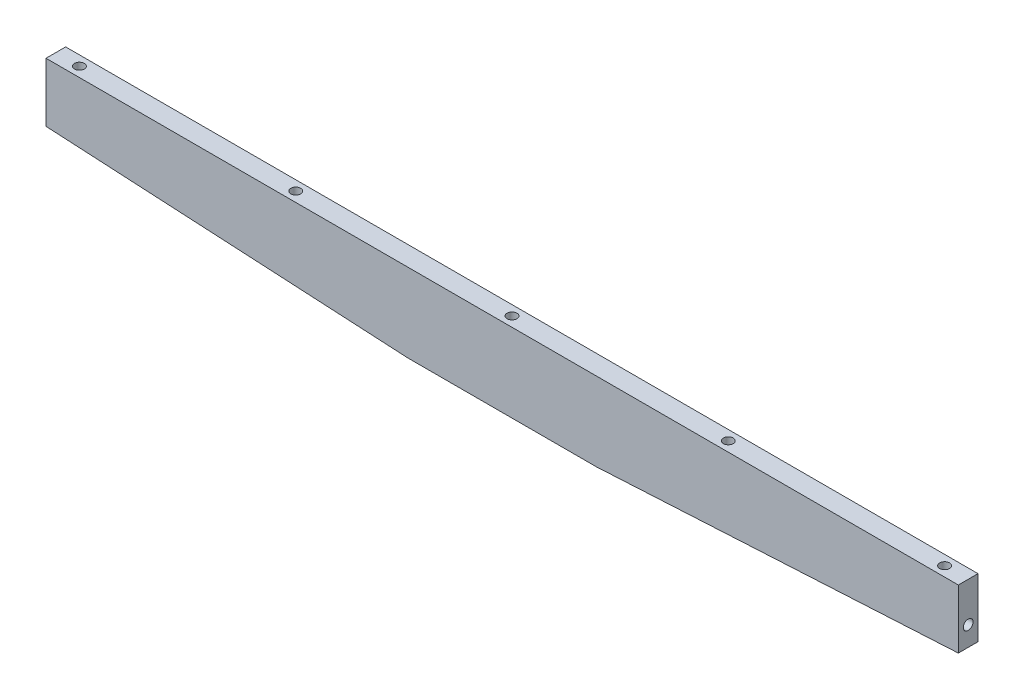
ISO-10303-21;
HEADER;
FILE_DESCRIPTION(('STEP AP214'),'2;1');
FILE_NAME('part.step','',(''),(''),'','','');
FILE_SCHEMA(('AUTOMOTIVE_DESIGN { 1 0 10303 214 1 1 1 1 }'));
ENDSEC;
DATA;
#1=APPLICATION_CONTEXT('core data for automotive mechanical design processes');
#2=APPLICATION_PROTOCOL_DEFINITION('international standard','automotive_design',2000,#1);
#3=PRODUCT_CONTEXT('',#1,'mechanical');
#4=PRODUCT('Part','Part','',(#3));
#5=PRODUCT_RELATED_PRODUCT_CATEGORY('part','',(#4));
#6=PRODUCT_DEFINITION_FORMATION('','',#4);
#7=PRODUCT_DEFINITION_CONTEXT('part definition',#1,'design');
#8=PRODUCT_DEFINITION('design','',#6,#7);
#9=PRODUCT_DEFINITION_SHAPE('','',#8);
#10=(LENGTH_UNIT() NAMED_UNIT(*) SI_UNIT(.MILLI.,.METRE.));
#11=(NAMED_UNIT(*) PLANE_ANGLE_UNIT() SI_UNIT($,.RADIAN.));
#12=(NAMED_UNIT(*) SI_UNIT($,.STERADIAN.) SOLID_ANGLE_UNIT());
#13=UNCERTAINTY_MEASURE_WITH_UNIT(LENGTH_MEASURE(1.E-05),#10,'distance_accuracy_value','');
#14=(GEOMETRIC_REPRESENTATION_CONTEXT(3) GLOBAL_UNCERTAINTY_ASSIGNED_CONTEXT((#13)) GLOBAL_UNIT_ASSIGNED_CONTEXT((#10,
#11,#12)) REPRESENTATION_CONTEXT('',''));
#15=CARTESIAN_POINT('',(0.,0.,0.));
#16=DIRECTION('',(0.,0.,1.));
#17=DIRECTION('',(1.,0.,0.));
#18=AXIS2_PLACEMENT_3D('',#15,#16,#17);
#19=CARTESIAN_POINT('',(-294.64,0.,6.35));
#20=DIRECTION('',(1.,0.,0.));
#21=DIRECTION('',(0.,0.,-1.));
#22=AXIS2_PLACEMENT_3D('',#19,#20,#21);
#23=PLANE('',#22);
#24=CARTESIAN_POINT('',(-294.64,-25.4,0.));
#25=DIRECTION('',(-1.,0.,0.));
#26=DIRECTION('',(0.,0.,1.));
#27=AXIS2_PLACEMENT_3D('',#24,#25,#26);
#28=CIRCLE('',#27,3.175);
#29=CARTESIAN_POINT('',(-294.64,-25.4,3.175));
#30=VERTEX_POINT('',#29);
#31=EDGE_CURVE('E150',#30,#30,#28,.T.);
#32=ORIENTED_EDGE('',*,*,#31,.F.);
#33=EDGE_LOOP('',(#32));
#34=FACE_BOUND('',#33,.T.);
#35=DIRECTION('',(0.,-1.,0.));
#36=VECTOR('',#35,1.);
#37=CARTESIAN_POINT('',(-294.64,0.,-6.35));
#38=LINE('',#37,#36);
#39=CARTESIAN_POINT('',(-294.64,0.,-6.35));
#40=VERTEX_POINT('',#39);
#41=CARTESIAN_POINT('',(-294.64,-38.1,-6.35));
#42=VERTEX_POINT('',#41);
#43=EDGE_CURVE('E132',#40,#42,#38,.T.);
#44=ORIENTED_EDGE('',*,*,#43,.T.);
#45=DIRECTION('',(0.,0.,-1.));
#46=VECTOR('',#45,1.);
#47=CARTESIAN_POINT('',(-294.64,-38.1,6.35));
#48=LINE('',#47,#46);
#49=CARTESIAN_POINT('',(-294.64,-38.1,6.35));
#50=VERTEX_POINT('',#49);
#51=EDGE_CURVE('E13',#50,#42,#48,.T.);
#52=ORIENTED_EDGE('',*,*,#51,.F.);
#53=DIRECTION('',(0.,-1.,0.));
#54=VECTOR('',#53,1.);
#55=CARTESIAN_POINT('',(-294.64,0.,6.35));
#56=LINE('',#55,#54);
#57=CARTESIAN_POINT('',(-294.64,0.,6.35));
#58=VERTEX_POINT('',#57);
#59=EDGE_CURVE('E143',#58,#50,#56,.T.);
#60=ORIENTED_EDGE('',*,*,#59,.F.);
#61=DIRECTION('',(0.,0.,-1.));
#62=VECTOR('',#61,1.);
#63=CARTESIAN_POINT('',(-294.64,0.,6.35));
#64=LINE('',#63,#62);
#65=EDGE_CURVE('E128',#58,#40,#64,.T.);
#66=ORIENTED_EDGE('',*,*,#65,.T.);
#67=EDGE_LOOP('',(#44,#52,#60,#66));
#68=FACE_BOUND('',#67,.T.);
#69=ADVANCED_FACE('F46',(#34,#68),#23,.F.);
#70=CARTESIAN_POINT('',(-294.64,-38.1,6.35));
#71=DIRECTION('',(0.0542677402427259,0.998526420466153,0.));
#72=DIRECTION('',(-0.998526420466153,0.0542677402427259,0.));
#73=AXIS2_PLACEMENT_3D('',#70,#71,#72);
#74=PLANE('',#73);
#75=CARTESIAN_POINT('',(-250.19,-40.5157608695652,0.));
#76=DIRECTION('',(0.0542677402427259,0.998526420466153,0.));
#77=DIRECTION('',(0.998526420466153,-0.0542677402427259,0.));
#78=AXIS2_PLACEMENT_3D('',#75,#76,#77);
#79=ELLIPSE('',#78,3.17968551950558,3.17499999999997);
#80=CARTESIAN_POINT('',(-247.015,-40.6883152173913,0.));
#81=VERTEX_POINT('',#80);
#82=EDGE_CURVE('E49',#81,#81,#79,.T.);
#83=ORIENTED_EDGE('',*,*,#82,.T.);
#84=EDGE_LOOP('',(#83));
#85=FACE_BOUND('',#84,.T.);
#86=DIRECTION('',(0.998526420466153,-0.0542677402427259,0.));
#87=VECTOR('',#86,1.);
#88=CARTESIAN_POINT('',(-294.64,-38.1,-6.35));
#89=LINE('',#88,#87);
#90=CARTESIAN_POINT('',(-60.96,-50.8,-6.35));
#91=VERTEX_POINT('',#90);
#92=EDGE_CURVE('E135',#42,#91,#89,.T.);
#93=ORIENTED_EDGE('',*,*,#92,.T.);
#94=DIRECTION('',(0.,0.,-1.));
#95=VECTOR('',#94,1.);
#96=CARTESIAN_POINT('',(-60.96,-50.8,6.35));
#97=LINE('',#96,#95);
#98=CARTESIAN_POINT('',(-60.96,-50.8,6.35));
#99=VERTEX_POINT('',#98);
#100=EDGE_CURVE('E55',#99,#91,#97,.T.);
#101=ORIENTED_EDGE('',*,*,#100,.F.);
#102=DIRECTION('',(0.998526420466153,-0.0542677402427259,0.));
#103=VECTOR('',#102,1.);
#104=CARTESIAN_POINT('',(-294.64,-38.1,6.35));
#105=LINE('',#104,#103);
#106=EDGE_CURVE('E101',#50,#99,#105,.T.);
#107=ORIENTED_EDGE('',*,*,#106,.F.);
#108=ORIENTED_EDGE('',*,*,#51,.T.);
#109=EDGE_LOOP('',(#93,#101,#107,#108));
#110=FACE_BOUND('',#109,.T.);
#111=ADVANCED_FACE('F201',(#85,#110),#74,.F.);
#112=CARTESIAN_POINT('',(-60.96,-50.8,6.35));
#113=DIRECTION('',(0.,1.,0.));
#114=DIRECTION('',(0.,0.,1.));
#115=AXIS2_PLACEMENT_3D('',#112,#113,#114);
#116=PLANE('',#115);
#117=DIRECTION('',(1.,0.,0.));
#118=VECTOR('',#117,1.);
#119=CARTESIAN_POINT('',(-60.96,-50.8,-6.35));
#120=LINE('',#119,#118);
#121=CARTESIAN_POINT('',(60.96,-50.8,-6.35));
#122=VERTEX_POINT('',#121);
#123=EDGE_CURVE('E138',#91,#122,#120,.T.);
#124=ORIENTED_EDGE('',*,*,#123,.T.);
#125=DIRECTION('',(0.,0.,-1.));
#126=VECTOR('',#125,1.);
#127=CARTESIAN_POINT('',(60.96,-50.8,6.35));
#128=LINE('',#127,#126);
#129=CARTESIAN_POINT('',(60.96,-50.8,6.35));
#130=VERTEX_POINT('',#129);
#131=EDGE_CURVE('E123',#130,#122,#128,.T.);
#132=ORIENTED_EDGE('',*,*,#131,.F.);
#133=DIRECTION('',(1.,0.,0.));
#134=VECTOR('',#133,1.);
#135=CARTESIAN_POINT('',(-60.96,-50.8,6.35));
#136=LINE('',#135,#134);
#137=EDGE_CURVE('E114',#99,#130,#136,.T.);
#138=ORIENTED_EDGE('',*,*,#137,.F.);
#139=ORIENTED_EDGE('',*,*,#100,.T.);
#140=EDGE_LOOP('',(#124,#132,#138,#139));
#141=FACE_BOUND('',#140,.T.);
#142=ADVANCED_FACE('F204',(#141),#116,.F.);
#143=CARTESIAN_POINT('',(294.64,-38.1,6.35));
#144=DIRECTION('',(-0.0542677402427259,0.998526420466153,0.));
#145=DIRECTION('',(-0.998526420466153,-0.0542677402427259,0.));
#146=AXIS2_PLACEMENT_3D('',#143,#144,#145);
#147=PLANE('',#146);
#148=CARTESIAN_POINT('',(250.19,-40.5157608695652,0.));
#149=DIRECTION('',(-0.0542677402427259,0.998526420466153,0.));
#150=DIRECTION('',(-0.998526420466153,-0.0542677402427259,0.));
#151=AXIS2_PLACEMENT_3D('',#148,#149,#150);
#152=ELLIPSE('',#151,3.17968551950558,3.17499999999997);
#153=CARTESIAN_POINT('',(247.015,-40.6883152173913,0.));
#154=VERTEX_POINT('',#153);
#155=EDGE_CURVE('E148',#154,#154,#152,.F.);
#156=ORIENTED_EDGE('',*,*,#155,.F.);
#157=EDGE_LOOP('',(#156));
#158=FACE_BOUND('',#157,.T.);
#159=DIRECTION('',(0.998526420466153,0.0542677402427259,0.));
#160=VECTOR('',#159,1.);
#161=CARTESIAN_POINT('',(294.64,-38.1,-6.35));
#162=LINE('',#161,#160);
#163=CARTESIAN_POINT('',(294.64,-38.1,-6.35));
#164=VERTEX_POINT('',#163);
#165=EDGE_CURVE('E122',#122,#164,#162,.T.);
#166=ORIENTED_EDGE('',*,*,#165,.T.);
#167=DIRECTION('',(0.,0.,-1.));
#168=VECTOR('',#167,1.);
#169=CARTESIAN_POINT('',(294.64,-38.1,6.35));
#170=LINE('',#169,#168);
#171=CARTESIAN_POINT('',(294.64,-38.1,6.35));
#172=VERTEX_POINT('',#171);
#173=EDGE_CURVE('E119',#172,#164,#170,.T.);
#174=ORIENTED_EDGE('',*,*,#173,.F.);
#175=DIRECTION('',(0.998526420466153,0.0542677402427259,0.));
#176=VECTOR('',#175,1.);
#177=CARTESIAN_POINT('',(294.64,-38.1,6.35));
#178=LINE('',#177,#176);
#179=EDGE_CURVE('E108',#130,#172,#178,.T.);
#180=ORIENTED_EDGE('',*,*,#179,.F.);
#181=ORIENTED_EDGE('',*,*,#131,.T.);
#182=EDGE_LOOP('',(#166,#174,#180,#181));
#183=FACE_BOUND('',#182,.T.);
#184=ADVANCED_FACE('F120',(#158,#183),#147,.F.);
#185=CARTESIAN_POINT('',(294.64,0.,6.35));
#186=DIRECTION('',(-1.,0.,0.));
#187=DIRECTION('',(0.,0.,1.));
#188=AXIS2_PLACEMENT_3D('',#185,#186,#187);
#189=PLANE('',#188);
#190=CARTESIAN_POINT('',(294.64,-25.4,0.));
#191=DIRECTION('',(-1.,0.,0.));
#192=DIRECTION('',(0.,0.,1.));
#193=AXIS2_PLACEMENT_3D('',#190,#191,#192);
#194=CIRCLE('',#193,3.175);
#195=CARTESIAN_POINT('',(294.64,-25.4,-3.175));
#196=VERTEX_POINT('',#195);
#197=EDGE_CURVE('E163',#196,#196,#194,.T.);
#198=ORIENTED_EDGE('',*,*,#197,.T.);
#199=EDGE_LOOP('',(#198));
#200=FACE_BOUND('',#199,.T.);
#201=DIRECTION('',(0.,1.,0.));
#202=VECTOR('',#201,1.);
#203=CARTESIAN_POINT('',(294.64,0.,-6.35));
#204=LINE('',#203,#202);
#205=CARTESIAN_POINT('',(294.64,0.,-6.35));
#206=VERTEX_POINT('',#205);
#207=EDGE_CURVE('E87',#164,#206,#204,.T.);
#208=ORIENTED_EDGE('',*,*,#207,.T.);
#209=DIRECTION('',(0.,0.,-1.));
#210=VECTOR('',#209,1.);
#211=CARTESIAN_POINT('',(294.64,0.,6.35));
#212=LINE('',#211,#210);
#213=CARTESIAN_POINT('',(294.64,0.,6.35));
#214=VERTEX_POINT('',#213);
#215=EDGE_CURVE('E124',#214,#206,#212,.T.);
#216=ORIENTED_EDGE('',*,*,#215,.F.);
#217=DIRECTION('',(0.,1.,0.));
#218=VECTOR('',#217,1.);
#219=CARTESIAN_POINT('',(294.64,0.,6.35));
#220=LINE('',#219,#218);
#221=EDGE_CURVE('E112',#172,#214,#220,.T.);
#222=ORIENTED_EDGE('',*,*,#221,.F.);
#223=ORIENTED_EDGE('',*,*,#173,.T.);
#224=EDGE_LOOP('',(#208,#216,#222,#223));
#225=FACE_BOUND('',#224,.T.);
#226=ADVANCED_FACE('F126',(#200,#225),#189,.F.);
#227=CARTESIAN_POINT('',(294.64,0.,6.35));
#228=DIRECTION('',(0.,-1.,0.));
#229=DIRECTION('',(0.,0.,-1.));
#230=AXIS2_PLACEMENT_3D('',#227,#228,#229);
#231=PLANE('',#230);
#232=CARTESIAN_POINT('',(-139.7,0.,0.));
#233=DIRECTION('',(0.,1.,0.));
#234=DIRECTION('',(0.,0.,1.));
#235=AXIS2_PLACEMENT_3D('',#232,#233,#234);
#236=CIRCLE('',#235,3.17499999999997);
#237=CARTESIAN_POINT('',(-139.7,0.,3.17499999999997));
#238=VERTEX_POINT('',#237);
#239=EDGE_CURVE('E174',#238,#238,#236,.T.);
#240=ORIENTED_EDGE('',*,*,#239,.F.);
#241=EDGE_LOOP('',(#240));
#242=FACE_BOUND('',#241,.T.);
#243=CARTESIAN_POINT('',(0.,0.,0.));
#244=DIRECTION('',(0.,1.,0.));
#245=DIRECTION('',(0.,0.,1.));
#246=AXIS2_PLACEMENT_3D('',#243,#244,#245);
#247=CIRCLE('',#246,3.17499999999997);
#248=CARTESIAN_POINT('',(0.,0.,3.17499999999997));
#249=VERTEX_POINT('',#248);
#250=EDGE_CURVE('E180',#249,#249,#247,.T.);
#251=ORIENTED_EDGE('',*,*,#250,.F.);
#252=EDGE_LOOP('',(#251));
#253=FACE_BOUND('',#252,.T.);
#254=CARTESIAN_POINT('',(139.7,0.,0.));
#255=DIRECTION('',(0.,1.,0.));
#256=DIRECTION('',(0.,0.,1.));
#257=AXIS2_PLACEMENT_3D('',#254,#255,#256);
#258=CIRCLE('',#257,3.17499999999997);
#259=CARTESIAN_POINT('',(139.7,0.,3.17499999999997));
#260=VERTEX_POINT('',#259);
#261=EDGE_CURVE('E186',#260,#260,#258,.T.);
#262=ORIENTED_EDGE('',*,*,#261,.F.);
#263=EDGE_LOOP('',(#262));
#264=FACE_BOUND('',#263,.T.);
#265=CARTESIAN_POINT('',(279.4,0.,0.));
#266=DIRECTION('',(0.,1.,0.));
#267=DIRECTION('',(0.,0.,1.));
#268=AXIS2_PLACEMENT_3D('',#265,#266,#267);
#269=CIRCLE('',#268,3.17499999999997);
#270=CARTESIAN_POINT('',(279.4,0.,3.17499999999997));
#271=VERTEX_POINT('',#270);
#272=EDGE_CURVE('E168',#271,#271,#269,.T.);
#273=ORIENTED_EDGE('',*,*,#272,.F.);
#274=EDGE_LOOP('',(#273));
#275=FACE_BOUND('',#274,.T.);
#276=CARTESIAN_POINT('',(-279.4,0.,0.));
#277=DIRECTION('',(0.,1.,0.));
#278=DIRECTION('',(0.,0.,1.));
#279=AXIS2_PLACEMENT_3D('',#276,#277,#278);
#280=CIRCLE('',#279,3.17499999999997);
#281=CARTESIAN_POINT('',(-279.4,0.,3.17499999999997));
#282=VERTEX_POINT('',#281);
#283=EDGE_CURVE('E173',#282,#282,#280,.T.);
#284=ORIENTED_EDGE('',*,*,#283,.F.);
#285=EDGE_LOOP('',(#284));
#286=FACE_BOUND('',#285,.T.);
#287=DIRECTION('',(-1.,0.,0.));
#288=VECTOR('',#287,1.);
#289=CARTESIAN_POINT('',(294.64,0.,-6.35));
#290=LINE('',#289,#288);
#291=EDGE_CURVE('E93',#206,#40,#290,.T.);
#292=ORIENTED_EDGE('',*,*,#291,.T.);
#293=ORIENTED_EDGE('',*,*,#65,.F.);
#294=DIRECTION('',(-1.,0.,0.));
#295=VECTOR('',#294,1.);
#296=CARTESIAN_POINT('',(294.64,0.,6.35));
#297=LINE('',#296,#295);
#298=EDGE_CURVE('E64',#214,#58,#297,.T.);
#299=ORIENTED_EDGE('',*,*,#298,.F.);
#300=ORIENTED_EDGE('',*,*,#215,.T.);
#301=EDGE_LOOP('',(#292,#293,#299,#300));
#302=FACE_BOUND('',#301,.T.);
#303=ADVANCED_FACE('F209',(#242,#253,#264,#275,#286,#302),#231,.F.);
#304=CARTESIAN_POINT('',(0.,0.,6.35));
#305=DIRECTION('',(0.,0.,1.));
#306=DIRECTION('',(1.,0.,0.));
#307=AXIS2_PLACEMENT_3D('',#304,#305,#306);
#308=PLANE('',#307);
#309=ORIENTED_EDGE('',*,*,#59,.T.);
#310=ORIENTED_EDGE('',*,*,#106,.T.);
#311=ORIENTED_EDGE('',*,*,#137,.T.);
#312=ORIENTED_EDGE('',*,*,#179,.T.);
#313=ORIENTED_EDGE('',*,*,#221,.T.);
#314=ORIENTED_EDGE('',*,*,#298,.T.);
#315=EDGE_LOOP('',(#309,#310,#311,#312,#313,#314));
#316=FACE_BOUND('',#315,.T.);
#317=ADVANCED_FACE('F110',(#316),#308,.T.);
#318=CARTESIAN_POINT('',(0.,0.,-6.35));
#319=DIRECTION('',(0.,0.,1.));
#320=DIRECTION('',(1.,0.,0.));
#321=AXIS2_PLACEMENT_3D('',#318,#319,#320);
#322=PLANE('',#321);
#323=ORIENTED_EDGE('',*,*,#43,.F.);
#324=ORIENTED_EDGE('',*,*,#291,.F.);
#325=ORIENTED_EDGE('',*,*,#207,.F.);
#326=ORIENTED_EDGE('',*,*,#165,.F.);
#327=ORIENTED_EDGE('',*,*,#123,.F.);
#328=ORIENTED_EDGE('',*,*,#92,.F.);
#329=EDGE_LOOP('',(#323,#324,#325,#326,#327,#328));
#330=FACE_BOUND('',#329,.T.);
#331=ADVANCED_FACE('F207',(#330),#322,.F.);
#332=CARTESIAN_POINT('',(-279.4,-19.05,0.));
#333=DIRECTION('',(0.,1.,0.));
#334=DIRECTION('',(0.,0.,1.));
#335=AXIS2_PLACEMENT_3D('',#332,#333,#334);
#336=CYLINDRICAL_SURFACE('',#335,3.17499999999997);
#337=CARTESIAN_POINT('',(-279.4,-19.05,0.));
#338=DIRECTION('',(0.,1.,0.));
#339=DIRECTION('',(0.,0.,1.));
#340=AXIS2_PLACEMENT_3D('',#337,#338,#339);
#341=CIRCLE('',#340,3.17499999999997);
#342=CARTESIAN_POINT('',(-279.4,-19.05,3.17499999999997));
#343=VERTEX_POINT('',#342);
#344=EDGE_CURVE('E136',#343,#343,#341,.T.);
#345=CARTESIAN_POINT('',(-279.4,-19.05,3.17499999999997));
#346=CARTESIAN_POINT('',(-279.4,-18.8515625,3.17499999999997));
#347=CARTESIAN_POINT('',(-279.4,-18.653125,3.17499999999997));
#348=CARTESIAN_POINT('',(-279.4,-18.25625,3.17499999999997));
#349=CARTESIAN_POINT('',(-279.4,-18.0578125,3.17499999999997));
#350=CARTESIAN_POINT('',(-279.4,-17.6609375,3.17499999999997));
#351=CARTESIAN_POINT('',(-279.4,-17.4625,3.17499999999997));
#352=CARTESIAN_POINT('',(-279.4,-17.065625,3.17499999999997));
#353=CARTESIAN_POINT('',(-279.4,-16.8671875,3.17499999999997));
#354=CARTESIAN_POINT('',(-279.4,-16.4703125,3.17499999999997));
#355=CARTESIAN_POINT('',(-279.4,-16.271875,3.17499999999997));
#356=CARTESIAN_POINT('',(-279.4,-15.875,3.17499999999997));
#357=CARTESIAN_POINT('',(-279.4,-15.6765625,3.17499999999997));
#358=CARTESIAN_POINT('',(-279.4,-15.2796875,3.17499999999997));
#359=CARTESIAN_POINT('',(-279.4,-15.08125,3.17499999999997));
#360=CARTESIAN_POINT('',(-279.4,-14.684375,3.17499999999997));
#361=CARTESIAN_POINT('',(-279.4,-14.4859375,3.17499999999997));
#362=CARTESIAN_POINT('',(-279.4,-14.0890625,3.17499999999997));
#363=CARTESIAN_POINT('',(-279.4,-13.890625,3.17499999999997));
#364=CARTESIAN_POINT('',(-279.4,-13.49375,3.17499999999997));
#365=CARTESIAN_POINT('',(-279.4,-13.2953125,3.17499999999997));
#366=CARTESIAN_POINT('',(-279.4,-12.8984375,3.17499999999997));
#367=CARTESIAN_POINT('',(-279.4,-12.7,3.17499999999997));
#368=CARTESIAN_POINT('',(-279.4,-12.303125,3.17499999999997));
#369=CARTESIAN_POINT('',(-279.4,-12.1046875,3.17499999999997));
#370=CARTESIAN_POINT('',(-279.4,-11.7078125,3.17499999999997));
#371=CARTESIAN_POINT('',(-279.4,-11.509375,3.17499999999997));
#372=CARTESIAN_POINT('',(-279.4,-11.1125,3.17499999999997));
#373=CARTESIAN_POINT('',(-279.4,-10.9140625,3.17499999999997));
#374=CARTESIAN_POINT('',(-279.4,-10.5171875,3.17499999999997));
#375=CARTESIAN_POINT('',(-279.4,-10.31875,3.17499999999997));
#376=CARTESIAN_POINT('',(-279.4,-9.921875,3.17499999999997));
#377=CARTESIAN_POINT('',(-279.4,-9.7234375,3.17499999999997));
#378=CARTESIAN_POINT('',(-279.4,-9.3265625,3.17499999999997));
#379=CARTESIAN_POINT('',(-279.4,-9.128125,3.17499999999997));
#380=CARTESIAN_POINT('',(-279.4,-8.73125,3.17499999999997));
#381=CARTESIAN_POINT('',(-279.4,-8.5328125,3.17499999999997));
#382=CARTESIAN_POINT('',(-279.4,-8.1359375,3.17499999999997));
#383=CARTESIAN_POINT('',(-279.4,-7.9375,3.17499999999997));
#384=CARTESIAN_POINT('',(-279.4,-7.540625,3.17499999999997));
#385=CARTESIAN_POINT('',(-279.4,-7.3421875,3.17499999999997));
#386=CARTESIAN_POINT('',(-279.4,-6.9453125,3.17499999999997));
#387=CARTESIAN_POINT('',(-279.4,-6.746875,3.17499999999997));
#388=CARTESIAN_POINT('',(-279.4,-6.35,3.17499999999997));
#389=CARTESIAN_POINT('',(-279.4,-6.1515625,3.17499999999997));
#390=CARTESIAN_POINT('',(-279.4,-5.7546875,3.17499999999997));
#391=CARTESIAN_POINT('',(-279.4,-5.55625,3.17499999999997));
#392=CARTESIAN_POINT('',(-279.4,-5.159375,3.17499999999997));
#393=CARTESIAN_POINT('',(-279.4,-4.9609375,3.17499999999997));
#394=CARTESIAN_POINT('',(-279.4,-4.5640625,3.17499999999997));
#395=CARTESIAN_POINT('',(-279.4,-4.365625,3.17499999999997));
#396=CARTESIAN_POINT('',(-279.4,-3.96875,3.17499999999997));
#397=CARTESIAN_POINT('',(-279.4,-3.7703125,3.17499999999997));
#398=CARTESIAN_POINT('',(-279.4,-3.3734375,3.17499999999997));
#399=CARTESIAN_POINT('',(-279.4,-3.175,3.17499999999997));
#400=CARTESIAN_POINT('',(-279.4,-2.778125,3.17499999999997));
#401=CARTESIAN_POINT('',(-279.4,-2.5796875,3.17499999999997));
#402=CARTESIAN_POINT('',(-279.4,-2.1828125,3.17499999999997));
#403=CARTESIAN_POINT('',(-279.4,-1.984375,3.17499999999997));
#404=CARTESIAN_POINT('',(-279.4,-1.5875,3.17499999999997));
#405=CARTESIAN_POINT('',(-279.4,-1.3890625,3.17499999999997));
#406=CARTESIAN_POINT('',(-279.4,-0.992187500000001,3.17499999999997));
#407=CARTESIAN_POINT('',(-279.4,-0.793750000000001,3.17499999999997));
#408=CARTESIAN_POINT('',(-279.4,-0.396875,3.17499999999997));
#409=CARTESIAN_POINT('',(-279.4,-0.1984375,3.17499999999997));
#410=CARTESIAN_POINT('',(-279.4,0.,3.17499999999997));
#411=B_SPLINE_CURVE_WITH_KNOTS('',3,(#345,#346,#347,#348,#349,#350,#351,#352,#353,#354,#355,
#356,#357,#358,#359,#360,#361,#362,#363,#364,#365,#366,#367,#368,#369,#370,#371,#372,#373,#374,
#375,#376,#377,#378,#379,#380,#381,#382,#383,#384,#385,#386,#387,#388,#389,#390,#391,#392,#393,
#394,#395,#396,#397,#398,#399,#400,#401,#402,#403,#404,#405,#406,#407,#408,#409,#410),
.UNSPECIFIED.,.F.,.F.,(4,2,2,2,2,2,2,2,2,2,2,2,2,2,2,2,2,2,2,2,2,2,2,2,2,2,2,2,2,2,2,2,4),(0.,
0.5953125,1.190625,1.7859375,2.38125,2.9765625,3.571875,4.1671875,4.7625,5.3578125,5.953125,
6.5484375,7.14375,7.7390625,8.334375,8.9296875,9.525,10.1203125,10.715625,11.3109375,11.90625,
12.5015625,13.096875,13.6921875,14.2875,14.8828125,15.478125,16.0734375,16.66875,17.2640625,
17.859375,18.4546875,19.05),.UNSPECIFIED.);
#412=EDGE_CURVE('BSEAM280',#343,#282,#411,.T.);
#413=ORIENTED_EDGE('',*,*,#344,.F.);
#414=ORIENTED_EDGE('',*,*,#283,.T.);
#415=ORIENTED_EDGE('',*,*,#412,.T.);
#416=ORIENTED_EDGE('',*,*,#412,.F.);
#417=EDGE_LOOP('',(#413,#415,#414,#416));
#418=FACE_BOUND('',#417,.T.);
#419=ADVANCED_FACE('F280',(#418),#336,.F.);
#420=CARTESIAN_POINT('',(-279.4,-19.05,0.));
#421=DIRECTION('',(0.,1.,0.));
#422=DIRECTION('',(0.,0.,1.));
#423=AXIS2_PLACEMENT_3D('',#420,#421,#422);
#424=PLANE('',#423);
#425=ORIENTED_EDGE('',*,*,#344,.T.);
#426=EDGE_LOOP('',(#425));
#427=FACE_BOUND('',#426,.T.);
#428=ADVANCED_FACE('F276',(#427),#424,.T.);
#429=CARTESIAN_POINT('',(279.4,-19.05,0.));
#430=DIRECTION('',(0.,1.,0.));
#431=DIRECTION('',(0.,0.,1.));
#432=AXIS2_PLACEMENT_3D('',#429,#430,#431);
#433=CYLINDRICAL_SURFACE('',#432,3.17499999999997);
#434=CARTESIAN_POINT('',(279.4,-19.05,0.));
#435=DIRECTION('',(0.,1.,0.));
#436=DIRECTION('',(0.,0.,1.));
#437=AXIS2_PLACEMENT_3D('',#434,#435,#436);
#438=CIRCLE('',#437,3.17499999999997);
#439=CARTESIAN_POINT('',(279.4,-19.05,3.17499999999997));
#440=VERTEX_POINT('',#439);
#441=EDGE_CURVE('E189',#440,#440,#438,.T.);
#442=CARTESIAN_POINT('',(279.4,-19.05,3.17499999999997));
#443=CARTESIAN_POINT('',(279.4,-18.8515625,3.17499999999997));
#444=CARTESIAN_POINT('',(279.4,-18.653125,3.17499999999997));
#445=CARTESIAN_POINT('',(279.4,-18.25625,3.17499999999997));
#446=CARTESIAN_POINT('',(279.4,-18.0578125,3.17499999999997));
#447=CARTESIAN_POINT('',(279.4,-17.6609375,3.17499999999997));
#448=CARTESIAN_POINT('',(279.4,-17.4625,3.17499999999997));
#449=CARTESIAN_POINT('',(279.4,-17.065625,3.17499999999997));
#450=CARTESIAN_POINT('',(279.4,-16.8671875,3.17499999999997));
#451=CARTESIAN_POINT('',(279.4,-16.4703125,3.17499999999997));
#452=CARTESIAN_POINT('',(279.4,-16.271875,3.17499999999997));
#453=CARTESIAN_POINT('',(279.4,-15.875,3.17499999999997));
#454=CARTESIAN_POINT('',(279.4,-15.6765625,3.17499999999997));
#455=CARTESIAN_POINT('',(279.4,-15.2796875,3.17499999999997));
#456=CARTESIAN_POINT('',(279.4,-15.08125,3.17499999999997));
#457=CARTESIAN_POINT('',(279.4,-14.684375,3.17499999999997));
#458=CARTESIAN_POINT('',(279.4,-14.4859375,3.17499999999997));
#459=CARTESIAN_POINT('',(279.4,-14.0890625,3.17499999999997));
#460=CARTESIAN_POINT('',(279.4,-13.890625,3.17499999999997));
#461=CARTESIAN_POINT('',(279.4,-13.49375,3.17499999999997));
#462=CARTESIAN_POINT('',(279.4,-13.2953125,3.17499999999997));
#463=CARTESIAN_POINT('',(279.4,-12.8984375,3.17499999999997));
#464=CARTESIAN_POINT('',(279.4,-12.7,3.17499999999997));
#465=CARTESIAN_POINT('',(279.4,-12.303125,3.17499999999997));
#466=CARTESIAN_POINT('',(279.4,-12.1046875,3.17499999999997));
#467=CARTESIAN_POINT('',(279.4,-11.7078125,3.17499999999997));
#468=CARTESIAN_POINT('',(279.4,-11.509375,3.17499999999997));
#469=CARTESIAN_POINT('',(279.4,-11.1125,3.17499999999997));
#470=CARTESIAN_POINT('',(279.4,-10.9140625,3.17499999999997));
#471=CARTESIAN_POINT('',(279.4,-10.5171875,3.17499999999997));
#472=CARTESIAN_POINT('',(279.4,-10.31875,3.17499999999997));
#473=CARTESIAN_POINT('',(279.4,-9.921875,3.17499999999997));
#474=CARTESIAN_POINT('',(279.4,-9.7234375,3.17499999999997));
#475=CARTESIAN_POINT('',(279.4,-9.3265625,3.17499999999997));
#476=CARTESIAN_POINT('',(279.4,-9.128125,3.17499999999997));
#477=CARTESIAN_POINT('',(279.4,-8.73125,3.17499999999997));
#478=CARTESIAN_POINT('',(279.4,-8.5328125,3.17499999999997));
#479=CARTESIAN_POINT('',(279.4,-8.1359375,3.17499999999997));
#480=CARTESIAN_POINT('',(279.4,-7.9375,3.17499999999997));
#481=CARTESIAN_POINT('',(279.4,-7.540625,3.17499999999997));
#482=CARTESIAN_POINT('',(279.4,-7.3421875,3.17499999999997));
#483=CARTESIAN_POINT('',(279.4,-6.9453125,3.17499999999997));
#484=CARTESIAN_POINT('',(279.4,-6.746875,3.17499999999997));
#485=CARTESIAN_POINT('',(279.4,-6.35,3.17499999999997));
#486=CARTESIAN_POINT('',(279.4,-6.1515625,3.17499999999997));
#487=CARTESIAN_POINT('',(279.4,-5.7546875,3.17499999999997));
#488=CARTESIAN_POINT('',(279.4,-5.55625,3.17499999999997));
#489=CARTESIAN_POINT('',(279.4,-5.159375,3.17499999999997));
#490=CARTESIAN_POINT('',(279.4,-4.9609375,3.17499999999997));
#491=CARTESIAN_POINT('',(279.4,-4.5640625,3.17499999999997));
#492=CARTESIAN_POINT('',(279.4,-4.365625,3.17499999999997));
#493=CARTESIAN_POINT('',(279.4,-3.96875,3.17499999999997));
#494=CARTESIAN_POINT('',(279.4,-3.7703125,3.17499999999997));
#495=CARTESIAN_POINT('',(279.4,-3.3734375,3.17499999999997));
#496=CARTESIAN_POINT('',(279.4,-3.175,3.17499999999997));
#497=CARTESIAN_POINT('',(279.4,-2.778125,3.17499999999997));
#498=CARTESIAN_POINT('',(279.4,-2.5796875,3.17499999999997));
#499=CARTESIAN_POINT('',(279.4,-2.1828125,3.17499999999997));
#500=CARTESIAN_POINT('',(279.4,-1.984375,3.17499999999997));
#501=CARTESIAN_POINT('',(279.4,-1.5875,3.17499999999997));
#502=CARTESIAN_POINT('',(279.4,-1.3890625,3.17499999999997));
#503=CARTESIAN_POINT('',(279.4,-0.992187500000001,3.17499999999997));
#504=CARTESIAN_POINT('',(279.4,-0.793750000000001,3.17499999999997));
#505=CARTESIAN_POINT('',(279.4,-0.396875,3.17499999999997));
#506=CARTESIAN_POINT('',(279.4,-0.1984375,3.17499999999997));
#507=CARTESIAN_POINT('',(279.4,0.,3.17499999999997));
#508=B_SPLINE_CURVE_WITH_KNOTS('',3,(#442,#443,#444,#445,#446,#447,#448,#449,#450,#451,#452,
#453,#454,#455,#456,#457,#458,#459,#460,#461,#462,#463,#464,#465,#466,#467,#468,#469,#470,#471,
#472,#473,#474,#475,#476,#477,#478,#479,#480,#481,#482,#483,#484,#485,#486,#487,#488,#489,#490,
#491,#492,#493,#494,#495,#496,#497,#498,#499,#500,#501,#502,#503,#504,#505,#506,#507),
.UNSPECIFIED.,.F.,.F.,(4,2,2,2,2,2,2,2,2,2,2,2,2,2,2,2,2,2,2,2,2,2,2,2,2,2,2,2,2,2,2,2,4),(0.,
0.5953125,1.190625,1.7859375,2.38125,2.9765625,3.571875,4.1671875,4.7625,5.3578125,5.953125,
6.5484375,7.14375,7.7390625,8.334375,8.9296875,9.525,10.1203125,10.715625,11.3109375,11.90625,
12.5015625,13.096875,13.6921875,14.2875,14.8828125,15.478125,16.0734375,16.66875,17.2640625,
17.859375,18.4546875,19.05),.UNSPECIFIED.);
#509=EDGE_CURVE('BSEAM272',#440,#271,#508,.T.);
#510=ORIENTED_EDGE('',*,*,#441,.F.);
#511=ORIENTED_EDGE('',*,*,#272,.T.);
#512=ORIENTED_EDGE('',*,*,#509,.T.);
#513=ORIENTED_EDGE('',*,*,#509,.F.);
#514=EDGE_LOOP('',(#510,#512,#511,#513));
#515=FACE_BOUND('',#514,.T.);
#516=ADVANCED_FACE('F272',(#515),#433,.F.);
#517=CARTESIAN_POINT('',(279.4,-19.05,0.));
#518=DIRECTION('',(0.,1.,0.));
#519=DIRECTION('',(0.,0.,1.));
#520=AXIS2_PLACEMENT_3D('',#517,#518,#519);
#521=PLANE('',#520);
#522=ORIENTED_EDGE('',*,*,#441,.T.);
#523=EDGE_LOOP('',(#522));
#524=FACE_BOUND('',#523,.T.);
#525=ADVANCED_FACE('F268',(#524),#521,.T.);
#526=CARTESIAN_POINT('',(139.7,-19.05,0.));
#527=DIRECTION('',(0.,1.,0.));
#528=DIRECTION('',(0.,0.,1.));
#529=AXIS2_PLACEMENT_3D('',#526,#527,#528);
#530=CYLINDRICAL_SURFACE('',#529,3.17499999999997);
#531=CARTESIAN_POINT('',(139.7,-19.05,0.));
#532=DIRECTION('',(0.,1.,0.));
#533=DIRECTION('',(0.,0.,1.));
#534=AXIS2_PLACEMENT_3D('',#531,#532,#533);
#535=CIRCLE('',#534,3.17499999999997);
#536=CARTESIAN_POINT('',(139.7,-19.05,3.17499999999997));
#537=VERTEX_POINT('',#536);
#538=EDGE_CURVE('E183',#537,#537,#535,.T.);
#539=CARTESIAN_POINT('',(139.7,-19.05,3.17499999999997));
#540=CARTESIAN_POINT('',(139.7,-18.8515625,3.17499999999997));
#541=CARTESIAN_POINT('',(139.7,-18.653125,3.17499999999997));
#542=CARTESIAN_POINT('',(139.7,-18.25625,3.17499999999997));
#543=CARTESIAN_POINT('',(139.7,-18.0578125,3.17499999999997));
#544=CARTESIAN_POINT('',(139.7,-17.6609375,3.17499999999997));
#545=CARTESIAN_POINT('',(139.7,-17.4625,3.17499999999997));
#546=CARTESIAN_POINT('',(139.7,-17.065625,3.17499999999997));
#547=CARTESIAN_POINT('',(139.7,-16.8671875,3.17499999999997));
#548=CARTESIAN_POINT('',(139.7,-16.4703125,3.17499999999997));
#549=CARTESIAN_POINT('',(139.7,-16.271875,3.17499999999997));
#550=CARTESIAN_POINT('',(139.7,-15.875,3.17499999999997));
#551=CARTESIAN_POINT('',(139.7,-15.6765625,3.17499999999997));
#552=CARTESIAN_POINT('',(139.7,-15.2796875,3.17499999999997));
#553=CARTESIAN_POINT('',(139.7,-15.08125,3.17499999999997));
#554=CARTESIAN_POINT('',(139.7,-14.684375,3.17499999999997));
#555=CARTESIAN_POINT('',(139.7,-14.4859375,3.17499999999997));
#556=CARTESIAN_POINT('',(139.7,-14.0890625,3.17499999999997));
#557=CARTESIAN_POINT('',(139.7,-13.890625,3.17499999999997));
#558=CARTESIAN_POINT('',(139.7,-13.49375,3.17499999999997));
#559=CARTESIAN_POINT('',(139.7,-13.2953125,3.17499999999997));
#560=CARTESIAN_POINT('',(139.7,-12.8984375,3.17499999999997));
#561=CARTESIAN_POINT('',(139.7,-12.7,3.17499999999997));
#562=CARTESIAN_POINT('',(139.7,-12.303125,3.17499999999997));
#563=CARTESIAN_POINT('',(139.7,-12.1046875,3.17499999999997));
#564=CARTESIAN_POINT('',(139.7,-11.7078125,3.17499999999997));
#565=CARTESIAN_POINT('',(139.7,-11.509375,3.17499999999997));
#566=CARTESIAN_POINT('',(139.7,-11.1125,3.17499999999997));
#567=CARTESIAN_POINT('',(139.7,-10.9140625,3.17499999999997));
#568=CARTESIAN_POINT('',(139.7,-10.5171875,3.17499999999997));
#569=CARTESIAN_POINT('',(139.7,-10.31875,3.17499999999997));
#570=CARTESIAN_POINT('',(139.7,-9.921875,3.17499999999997));
#571=CARTESIAN_POINT('',(139.7,-9.7234375,3.17499999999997));
#572=CARTESIAN_POINT('',(139.7,-9.3265625,3.17499999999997));
#573=CARTESIAN_POINT('',(139.7,-9.128125,3.17499999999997));
#574=CARTESIAN_POINT('',(139.7,-8.73125,3.17499999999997));
#575=CARTESIAN_POINT('',(139.7,-8.5328125,3.17499999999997));
#576=CARTESIAN_POINT('',(139.7,-8.1359375,3.17499999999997));
#577=CARTESIAN_POINT('',(139.7,-7.9375,3.17499999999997));
#578=CARTESIAN_POINT('',(139.7,-7.540625,3.17499999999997));
#579=CARTESIAN_POINT('',(139.7,-7.3421875,3.17499999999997));
#580=CARTESIAN_POINT('',(139.7,-6.9453125,3.17499999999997));
#581=CARTESIAN_POINT('',(139.7,-6.746875,3.17499999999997));
#582=CARTESIAN_POINT('',(139.7,-6.35,3.17499999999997));
#583=CARTESIAN_POINT('',(139.7,-6.1515625,3.17499999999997));
#584=CARTESIAN_POINT('',(139.7,-5.7546875,3.17499999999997));
#585=CARTESIAN_POINT('',(139.7,-5.55625,3.17499999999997));
#586=CARTESIAN_POINT('',(139.7,-5.159375,3.17499999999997));
#587=CARTESIAN_POINT('',(139.7,-4.9609375,3.17499999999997));
#588=CARTESIAN_POINT('',(139.7,-4.5640625,3.17499999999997));
#589=CARTESIAN_POINT('',(139.7,-4.365625,3.17499999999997));
#590=CARTESIAN_POINT('',(139.7,-3.96875,3.17499999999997));
#591=CARTESIAN_POINT('',(139.7,-3.7703125,3.17499999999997));
#592=CARTESIAN_POINT('',(139.7,-3.3734375,3.17499999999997));
#593=CARTESIAN_POINT('',(139.7,-3.175,3.17499999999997));
#594=CARTESIAN_POINT('',(139.7,-2.778125,3.17499999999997));
#595=CARTESIAN_POINT('',(139.7,-2.5796875,3.17499999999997));
#596=CARTESIAN_POINT('',(139.7,-2.1828125,3.17499999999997));
#597=CARTESIAN_POINT('',(139.7,-1.984375,3.17499999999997));
#598=CARTESIAN_POINT('',(139.7,-1.5875,3.17499999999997));
#599=CARTESIAN_POINT('',(139.7,-1.3890625,3.17499999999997));
#600=CARTESIAN_POINT('',(139.7,-0.992187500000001,3.17499999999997));
#601=CARTESIAN_POINT('',(139.7,-0.793750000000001,3.17499999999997));
#602=CARTESIAN_POINT('',(139.7,-0.396875,3.17499999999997));
#603=CARTESIAN_POINT('',(139.7,-0.1984375,3.17499999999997));
#604=CARTESIAN_POINT('',(139.7,0.,3.17499999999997));
#605=B_SPLINE_CURVE_WITH_KNOTS('',3,(#539,#540,#541,#542,#543,#544,#545,#546,#547,#548,#549,
#550,#551,#552,#553,#554,#555,#556,#557,#558,#559,#560,#561,#562,#563,#564,#565,#566,#567,#568,
#569,#570,#571,#572,#573,#574,#575,#576,#577,#578,#579,#580,#581,#582,#583,#584,#585,#586,#587,
#588,#589,#590,#591,#592,#593,#594,#595,#596,#597,#598,#599,#600,#601,#602,#603,#604),
.UNSPECIFIED.,.F.,.F.,(4,2,2,2,2,2,2,2,2,2,2,2,2,2,2,2,2,2,2,2,2,2,2,2,2,2,2,2,2,2,2,2,4),(0.,
0.5953125,1.190625,1.7859375,2.38125,2.9765625,3.571875,4.1671875,4.7625,5.3578125,5.953125,
6.5484375,7.14375,7.7390625,8.334375,8.9296875,9.525,10.1203125,10.715625,11.3109375,11.90625,
12.5015625,13.096875,13.6921875,14.2875,14.8828125,15.478125,16.0734375,16.66875,17.2640625,
17.859375,18.4546875,19.05),.UNSPECIFIED.);
#606=EDGE_CURVE('BSEAM264',#537,#260,#605,.T.);
#607=ORIENTED_EDGE('',*,*,#538,.F.);
#608=ORIENTED_EDGE('',*,*,#261,.T.);
#609=ORIENTED_EDGE('',*,*,#606,.T.);
#610=ORIENTED_EDGE('',*,*,#606,.F.);
#611=EDGE_LOOP('',(#607,#609,#608,#610));
#612=FACE_BOUND('',#611,.T.);
#613=ADVANCED_FACE('F264',(#612),#530,.F.);
#614=CARTESIAN_POINT('',(139.7,-19.05,0.));
#615=DIRECTION('',(0.,1.,0.));
#616=DIRECTION('',(0.,0.,1.));
#617=AXIS2_PLACEMENT_3D('',#614,#615,#616);
#618=PLANE('',#617);
#619=ORIENTED_EDGE('',*,*,#538,.T.);
#620=EDGE_LOOP('',(#619));
#621=FACE_BOUND('',#620,.T.);
#622=ADVANCED_FACE('F260',(#621),#618,.T.);
#623=CARTESIAN_POINT('',(0.,-19.05,0.));
#624=DIRECTION('',(0.,1.,0.));
#625=DIRECTION('',(0.,0.,1.));
#626=AXIS2_PLACEMENT_3D('',#623,#624,#625);
#627=CYLINDRICAL_SURFACE('',#626,3.17499999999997);
#628=CARTESIAN_POINT('',(0.,-19.05,0.));
#629=DIRECTION('',(0.,1.,0.));
#630=DIRECTION('',(0.,0.,1.));
#631=AXIS2_PLACEMENT_3D('',#628,#629,#630);
#632=CIRCLE('',#631,3.17499999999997);
#633=CARTESIAN_POINT('',(0.,-19.05,3.17499999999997));
#634=VERTEX_POINT('',#633);
#635=EDGE_CURVE('E177',#634,#634,#632,.T.);
#636=CARTESIAN_POINT('',(0.,-19.05,3.17499999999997));
#637=CARTESIAN_POINT('',(0.,-18.8515625,3.17499999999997));
#638=CARTESIAN_POINT('',(0.,-18.653125,3.17499999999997));
#639=CARTESIAN_POINT('',(0.,-18.25625,3.17499999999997));
#640=CARTESIAN_POINT('',(0.,-18.0578125,3.17499999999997));
#641=CARTESIAN_POINT('',(0.,-17.6609375,3.17499999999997));
#642=CARTESIAN_POINT('',(0.,-17.4625,3.17499999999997));
#643=CARTESIAN_POINT('',(0.,-17.065625,3.17499999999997));
#644=CARTESIAN_POINT('',(0.,-16.8671875,3.17499999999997));
#645=CARTESIAN_POINT('',(0.,-16.4703125,3.17499999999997));
#646=CARTESIAN_POINT('',(0.,-16.271875,3.17499999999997));
#647=CARTESIAN_POINT('',(0.,-15.875,3.17499999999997));
#648=CARTESIAN_POINT('',(0.,-15.6765625,3.17499999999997));
#649=CARTESIAN_POINT('',(0.,-15.2796875,3.17499999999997));
#650=CARTESIAN_POINT('',(0.,-15.08125,3.17499999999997));
#651=CARTESIAN_POINT('',(0.,-14.684375,3.17499999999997));
#652=CARTESIAN_POINT('',(0.,-14.4859375,3.17499999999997));
#653=CARTESIAN_POINT('',(0.,-14.0890625,3.17499999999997));
#654=CARTESIAN_POINT('',(0.,-13.890625,3.17499999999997));
#655=CARTESIAN_POINT('',(0.,-13.49375,3.17499999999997));
#656=CARTESIAN_POINT('',(0.,-13.2953125,3.17499999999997));
#657=CARTESIAN_POINT('',(0.,-12.8984375,3.17499999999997));
#658=CARTESIAN_POINT('',(0.,-12.7,3.17499999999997));
#659=CARTESIAN_POINT('',(0.,-12.303125,3.17499999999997));
#660=CARTESIAN_POINT('',(0.,-12.1046875,3.17499999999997));
#661=CARTESIAN_POINT('',(0.,-11.7078125,3.17499999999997));
#662=CARTESIAN_POINT('',(0.,-11.509375,3.17499999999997));
#663=CARTESIAN_POINT('',(0.,-11.1125,3.17499999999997));
#664=CARTESIAN_POINT('',(0.,-10.9140625,3.17499999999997));
#665=CARTESIAN_POINT('',(0.,-10.5171875,3.17499999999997));
#666=CARTESIAN_POINT('',(0.,-10.31875,3.17499999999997));
#667=CARTESIAN_POINT('',(0.,-9.921875,3.17499999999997));
#668=CARTESIAN_POINT('',(0.,-9.7234375,3.17499999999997));
#669=CARTESIAN_POINT('',(0.,-9.3265625,3.17499999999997));
#670=CARTESIAN_POINT('',(0.,-9.128125,3.17499999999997));
#671=CARTESIAN_POINT('',(0.,-8.73125,3.17499999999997));
#672=CARTESIAN_POINT('',(0.,-8.5328125,3.17499999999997));
#673=CARTESIAN_POINT('',(0.,-8.1359375,3.17499999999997));
#674=CARTESIAN_POINT('',(0.,-7.9375,3.17499999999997));
#675=CARTESIAN_POINT('',(0.,-7.540625,3.17499999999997));
#676=CARTESIAN_POINT('',(0.,-7.3421875,3.17499999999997));
#677=CARTESIAN_POINT('',(0.,-6.9453125,3.17499999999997));
#678=CARTESIAN_POINT('',(0.,-6.746875,3.17499999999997));
#679=CARTESIAN_POINT('',(0.,-6.35,3.17499999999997));
#680=CARTESIAN_POINT('',(0.,-6.1515625,3.17499999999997));
#681=CARTESIAN_POINT('',(0.,-5.7546875,3.17499999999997));
#682=CARTESIAN_POINT('',(0.,-5.55625,3.17499999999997));
#683=CARTESIAN_POINT('',(0.,-5.159375,3.17499999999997));
#684=CARTESIAN_POINT('',(0.,-4.9609375,3.17499999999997));
#685=CARTESIAN_POINT('',(0.,-4.5640625,3.17499999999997));
#686=CARTESIAN_POINT('',(0.,-4.365625,3.17499999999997));
#687=CARTESIAN_POINT('',(0.,-3.96875,3.17499999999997));
#688=CARTESIAN_POINT('',(0.,-3.7703125,3.17499999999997));
#689=CARTESIAN_POINT('',(0.,-3.3734375,3.17499999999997));
#690=CARTESIAN_POINT('',(0.,-3.175,3.17499999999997));
#691=CARTESIAN_POINT('',(0.,-2.778125,3.17499999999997));
#692=CARTESIAN_POINT('',(0.,-2.5796875,3.17499999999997));
#693=CARTESIAN_POINT('',(0.,-2.1828125,3.17499999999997));
#694=CARTESIAN_POINT('',(0.,-1.984375,3.17499999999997));
#695=CARTESIAN_POINT('',(0.,-1.5875,3.17499999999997));
#696=CARTESIAN_POINT('',(0.,-1.3890625,3.17499999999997));
#697=CARTESIAN_POINT('',(0.,-0.992187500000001,3.17499999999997));
#698=CARTESIAN_POINT('',(0.,-0.793750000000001,3.17499999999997));
#699=CARTESIAN_POINT('',(0.,-0.396875,3.17499999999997));
#700=CARTESIAN_POINT('',(0.,-0.1984375,3.17499999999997));
#701=CARTESIAN_POINT('',(0.,0.,3.17499999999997));
#702=B_SPLINE_CURVE_WITH_KNOTS('',3,(#636,#637,#638,#639,#640,#641,#642,#643,#644,#645,#646,
#647,#648,#649,#650,#651,#652,#653,#654,#655,#656,#657,#658,#659,#660,#661,#662,#663,#664,#665,
#666,#667,#668,#669,#670,#671,#672,#673,#674,#675,#676,#677,#678,#679,#680,#681,#682,#683,#684,
#685,#686,#687,#688,#689,#690,#691,#692,#693,#694,#695,#696,#697,#698,#699,#700,#701),
.UNSPECIFIED.,.F.,.F.,(4,2,2,2,2,2,2,2,2,2,2,2,2,2,2,2,2,2,2,2,2,2,2,2,2,2,2,2,2,2,2,2,4),(0.,
0.5953125,1.190625,1.7859375,2.38125,2.9765625,3.571875,4.1671875,4.7625,5.3578125,5.953125,
6.5484375,7.14375,7.7390625,8.334375,8.9296875,9.525,10.1203125,10.715625,11.3109375,11.90625,
12.5015625,13.096875,13.6921875,14.2875,14.8828125,15.478125,16.0734375,16.66875,17.2640625,
17.859375,18.4546875,19.05),.UNSPECIFIED.);
#703=EDGE_CURVE('BSEAM256',#634,#249,#702,.T.);
#704=ORIENTED_EDGE('',*,*,#635,.F.);
#705=ORIENTED_EDGE('',*,*,#250,.T.);
#706=ORIENTED_EDGE('',*,*,#703,.T.);
#707=ORIENTED_EDGE('',*,*,#703,.F.);
#708=EDGE_LOOP('',(#704,#706,#705,#707));
#709=FACE_BOUND('',#708,.T.);
#710=ADVANCED_FACE('F256',(#709),#627,.F.);
#711=CARTESIAN_POINT('',(0.,-19.05,0.));
#712=DIRECTION('',(0.,1.,0.));
#713=DIRECTION('',(0.,0.,1.));
#714=AXIS2_PLACEMENT_3D('',#711,#712,#713);
#715=PLANE('',#714);
#716=ORIENTED_EDGE('',*,*,#635,.T.);
#717=EDGE_LOOP('',(#716));
#718=FACE_BOUND('',#717,.T.);
#719=ADVANCED_FACE('F252',(#718),#715,.T.);
#720=CARTESIAN_POINT('',(-139.7,-19.05,0.));
#721=DIRECTION('',(0.,1.,0.));
#722=DIRECTION('',(0.,0.,1.));
#723=AXIS2_PLACEMENT_3D('',#720,#721,#722);
#724=CYLINDRICAL_SURFACE('',#723,3.17499999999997);
#725=CARTESIAN_POINT('',(-139.7,-19.05,0.));
#726=DIRECTION('',(0.,1.,0.));
#727=DIRECTION('',(0.,0.,1.));
#728=AXIS2_PLACEMENT_3D('',#725,#726,#727);
#729=CIRCLE('',#728,3.17499999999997);
#730=CARTESIAN_POINT('',(-139.7,-19.05,3.17499999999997));
#731=VERTEX_POINT('',#730);
#732=EDGE_CURVE('E170',#731,#731,#729,.T.);
#733=CARTESIAN_POINT('',(-139.7,-19.05,3.17499999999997));
#734=CARTESIAN_POINT('',(-139.7,-18.8515625,3.17499999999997));
#735=CARTESIAN_POINT('',(-139.7,-18.653125,3.17499999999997));
#736=CARTESIAN_POINT('',(-139.7,-18.25625,3.17499999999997));
#737=CARTESIAN_POINT('',(-139.7,-18.0578125,3.17499999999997));
#738=CARTESIAN_POINT('',(-139.7,-17.6609375,3.17499999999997));
#739=CARTESIAN_POINT('',(-139.7,-17.4625,3.17499999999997));
#740=CARTESIAN_POINT('',(-139.7,-17.065625,3.17499999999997));
#741=CARTESIAN_POINT('',(-139.7,-16.8671875,3.17499999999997));
#742=CARTESIAN_POINT('',(-139.7,-16.4703125,3.17499999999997));
#743=CARTESIAN_POINT('',(-139.7,-16.271875,3.17499999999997));
#744=CARTESIAN_POINT('',(-139.7,-15.875,3.17499999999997));
#745=CARTESIAN_POINT('',(-139.7,-15.6765625,3.17499999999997));
#746=CARTESIAN_POINT('',(-139.7,-15.2796875,3.17499999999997));
#747=CARTESIAN_POINT('',(-139.7,-15.08125,3.17499999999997));
#748=CARTESIAN_POINT('',(-139.7,-14.684375,3.17499999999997));
#749=CARTESIAN_POINT('',(-139.7,-14.4859375,3.17499999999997));
#750=CARTESIAN_POINT('',(-139.7,-14.0890625,3.17499999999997));
#751=CARTESIAN_POINT('',(-139.7,-13.890625,3.17499999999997));
#752=CARTESIAN_POINT('',(-139.7,-13.49375,3.17499999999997));
#753=CARTESIAN_POINT('',(-139.7,-13.2953125,3.17499999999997));
#754=CARTESIAN_POINT('',(-139.7,-12.8984375,3.17499999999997));
#755=CARTESIAN_POINT('',(-139.7,-12.7,3.17499999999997));
#756=CARTESIAN_POINT('',(-139.7,-12.303125,3.17499999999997));
#757=CARTESIAN_POINT('',(-139.7,-12.1046875,3.17499999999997));
#758=CARTESIAN_POINT('',(-139.7,-11.7078125,3.17499999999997));
#759=CARTESIAN_POINT('',(-139.7,-11.509375,3.17499999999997));
#760=CARTESIAN_POINT('',(-139.7,-11.1125,3.17499999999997));
#761=CARTESIAN_POINT('',(-139.7,-10.9140625,3.17499999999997));
#762=CARTESIAN_POINT('',(-139.7,-10.5171875,3.17499999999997));
#763=CARTESIAN_POINT('',(-139.7,-10.31875,3.17499999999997));
#764=CARTESIAN_POINT('',(-139.7,-9.921875,3.17499999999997));
#765=CARTESIAN_POINT('',(-139.7,-9.7234375,3.17499999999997));
#766=CARTESIAN_POINT('',(-139.7,-9.3265625,3.17499999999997));
#767=CARTESIAN_POINT('',(-139.7,-9.128125,3.17499999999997));
#768=CARTESIAN_POINT('',(-139.7,-8.73125,3.17499999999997));
#769=CARTESIAN_POINT('',(-139.7,-8.5328125,3.17499999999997));
#770=CARTESIAN_POINT('',(-139.7,-8.1359375,3.17499999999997));
#771=CARTESIAN_POINT('',(-139.7,-7.9375,3.17499999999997));
#772=CARTESIAN_POINT('',(-139.7,-7.540625,3.17499999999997));
#773=CARTESIAN_POINT('',(-139.7,-7.3421875,3.17499999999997));
#774=CARTESIAN_POINT('',(-139.7,-6.9453125,3.17499999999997));
#775=CARTESIAN_POINT('',(-139.7,-6.746875,3.17499999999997));
#776=CARTESIAN_POINT('',(-139.7,-6.35,3.17499999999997));
#777=CARTESIAN_POINT('',(-139.7,-6.1515625,3.17499999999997));
#778=CARTESIAN_POINT('',(-139.7,-5.7546875,3.17499999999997));
#779=CARTESIAN_POINT('',(-139.7,-5.55625,3.17499999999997));
#780=CARTESIAN_POINT('',(-139.7,-5.159375,3.17499999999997));
#781=CARTESIAN_POINT('',(-139.7,-4.9609375,3.17499999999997));
#782=CARTESIAN_POINT('',(-139.7,-4.5640625,3.17499999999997));
#783=CARTESIAN_POINT('',(-139.7,-4.365625,3.17499999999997));
#784=CARTESIAN_POINT('',(-139.7,-3.96875,3.17499999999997));
#785=CARTESIAN_POINT('',(-139.7,-3.7703125,3.17499999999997));
#786=CARTESIAN_POINT('',(-139.7,-3.3734375,3.17499999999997));
#787=CARTESIAN_POINT('',(-139.7,-3.175,3.17499999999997));
#788=CARTESIAN_POINT('',(-139.7,-2.778125,3.17499999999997));
#789=CARTESIAN_POINT('',(-139.7,-2.5796875,3.17499999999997));
#790=CARTESIAN_POINT('',(-139.7,-2.1828125,3.17499999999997));
#791=CARTESIAN_POINT('',(-139.7,-1.984375,3.17499999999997));
#792=CARTESIAN_POINT('',(-139.7,-1.5875,3.17499999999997));
#793=CARTESIAN_POINT('',(-139.7,-1.3890625,3.17499999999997));
#794=CARTESIAN_POINT('',(-139.7,-0.992187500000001,3.17499999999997));
#795=CARTESIAN_POINT('',(-139.7,-0.793750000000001,3.17499999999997));
#796=CARTESIAN_POINT('',(-139.7,-0.396875,3.17499999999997));
#797=CARTESIAN_POINT('',(-139.7,-0.1984375,3.17499999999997));
#798=CARTESIAN_POINT('',(-139.7,0.,3.17499999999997));
#799=B_SPLINE_CURVE_WITH_KNOTS('',3,(#733,#734,#735,#736,#737,#738,#739,#740,#741,#742,#743,
#744,#745,#746,#747,#748,#749,#750,#751,#752,#753,#754,#755,#756,#757,#758,#759,#760,#761,#762,
#763,#764,#765,#766,#767,#768,#769,#770,#771,#772,#773,#774,#775,#776,#777,#778,#779,#780,#781,
#782,#783,#784,#785,#786,#787,#788,#789,#790,#791,#792,#793,#794,#795,#796,#797,#798),
.UNSPECIFIED.,.F.,.F.,(4,2,2,2,2,2,2,2,2,2,2,2,2,2,2,2,2,2,2,2,2,2,2,2,2,2,2,2,2,2,2,2,4),(0.,
0.5953125,1.190625,1.7859375,2.38125,2.9765625,3.571875,4.1671875,4.7625,5.3578125,5.953125,
6.5484375,7.14375,7.7390625,8.334375,8.9296875,9.525,10.1203125,10.715625,11.3109375,11.90625,
12.5015625,13.096875,13.6921875,14.2875,14.8828125,15.478125,16.0734375,16.66875,17.2640625,
17.859375,18.4546875,19.05),.UNSPECIFIED.);
#800=EDGE_CURVE('BSEAM244',#731,#238,#799,.T.);
#801=ORIENTED_EDGE('',*,*,#732,.F.);
#802=ORIENTED_EDGE('',*,*,#239,.T.);
#803=ORIENTED_EDGE('',*,*,#800,.T.);
#804=ORIENTED_EDGE('',*,*,#800,.F.);
#805=EDGE_LOOP('',(#801,#803,#802,#804));
#806=FACE_BOUND('',#805,.T.);
#807=ADVANCED_FACE('F244',(#806),#724,.F.);
#808=CARTESIAN_POINT('',(-139.7,-19.05,0.));
#809=DIRECTION('',(0.,1.,0.));
#810=DIRECTION('',(0.,0.,1.));
#811=AXIS2_PLACEMENT_3D('',#808,#809,#810);
#812=PLANE('',#811);
#813=ORIENTED_EDGE('',*,*,#732,.T.);
#814=EDGE_LOOP('',(#813));
#815=FACE_BOUND('',#814,.T.);
#816=ADVANCED_FACE('F234',(#815),#812,.T.);
#817=CARTESIAN_POINT('',(-275.59,-25.4,0.));
#818=DIRECTION('',(-1.,0.,0.));
#819=DIRECTION('',(0.,0.,1.));
#820=AXIS2_PLACEMENT_3D('',#817,#818,#819);
#821=CYLINDRICAL_SURFACE('',#820,3.175);
#822=CARTESIAN_POINT('',(-275.59,-25.4,0.));
#823=DIRECTION('',(-1.,0.,0.));
#824=DIRECTION('',(0.,0.,1.));
#825=AXIS2_PLACEMENT_3D('',#822,#823,#824);
#826=CIRCLE('',#825,3.175);
#827=CARTESIAN_POINT('',(-275.59,-25.4,3.175));
#828=VERTEX_POINT('',#827);
#829=EDGE_CURVE('E155',#828,#828,#826,.T.);
#830=CARTESIAN_POINT('',(-275.59,-25.4,3.175));
#831=CARTESIAN_POINT('',(-275.7884375,-25.4,3.175));
#832=CARTESIAN_POINT('',(-275.986875,-25.4,3.175));
#833=CARTESIAN_POINT('',(-276.38375,-25.4,3.175));
#834=CARTESIAN_POINT('',(-276.5821875,-25.4,3.175));
#835=CARTESIAN_POINT('',(-276.9790625,-25.4,3.175));
#836=CARTESIAN_POINT('',(-277.1775,-25.4,3.175));
#837=CARTESIAN_POINT('',(-277.574375,-25.4,3.175));
#838=CARTESIAN_POINT('',(-277.7728125,-25.4,3.175));
#839=CARTESIAN_POINT('',(-278.1696875,-25.4,3.175));
#840=CARTESIAN_POINT('',(-278.368125,-25.4,3.175));
#841=CARTESIAN_POINT('',(-278.765,-25.4,3.175));
#842=CARTESIAN_POINT('',(-278.9634375,-25.4,3.175));
#843=CARTESIAN_POINT('',(-279.3603125,-25.4,3.175));
#844=CARTESIAN_POINT('',(-279.55875,-25.4,3.175));
#845=CARTESIAN_POINT('',(-279.955625,-25.4,3.175));
#846=CARTESIAN_POINT('',(-280.1540625,-25.4,3.175));
#847=CARTESIAN_POINT('',(-280.5509375,-25.4,3.175));
#848=CARTESIAN_POINT('',(-280.749375,-25.4,3.175));
#849=CARTESIAN_POINT('',(-281.14625,-25.4,3.175));
#850=CARTESIAN_POINT('',(-281.3446875,-25.4,3.175));
#851=CARTESIAN_POINT('',(-281.7415625,-25.4,3.175));
#852=CARTESIAN_POINT('',(-281.94,-25.4,3.175));
#853=CARTESIAN_POINT('',(-282.336875,-25.4,3.175));
#854=CARTESIAN_POINT('',(-282.5353125,-25.4,3.175));
#855=CARTESIAN_POINT('',(-282.9321875,-25.4,3.175));
#856=CARTESIAN_POINT('',(-283.130625,-25.4,3.175));
#857=CARTESIAN_POINT('',(-283.5275,-25.4,3.175));
#858=CARTESIAN_POINT('',(-283.7259375,-25.4,3.175));
#859=CARTESIAN_POINT('',(-284.1228125,-25.4,3.175));
#860=CARTESIAN_POINT('',(-284.32125,-25.4,3.175));
#861=CARTESIAN_POINT('',(-284.718125,-25.4,3.175));
#862=CARTESIAN_POINT('',(-284.9165625,-25.4,3.175));
#863=CARTESIAN_POINT('',(-285.3134375,-25.4,3.175));
#864=CARTESIAN_POINT('',(-285.511875,-25.4,3.175));
#865=CARTESIAN_POINT('',(-285.90875,-25.4,3.175));
#866=CARTESIAN_POINT('',(-286.1071875,-25.4,3.175));
#867=CARTESIAN_POINT('',(-286.5040625,-25.4,3.175));
#868=CARTESIAN_POINT('',(-286.7025,-25.4,3.175));
#869=CARTESIAN_POINT('',(-287.099375,-25.4,3.175));
#870=CARTESIAN_POINT('',(-287.2978125,-25.4,3.175));
#871=CARTESIAN_POINT('',(-287.6946875,-25.4,3.175));
#872=CARTESIAN_POINT('',(-287.893125,-25.4,3.175));
#873=CARTESIAN_POINT('',(-288.29,-25.4,3.175));
#874=CARTESIAN_POINT('',(-288.4884375,-25.4,3.175));
#875=CARTESIAN_POINT('',(-288.8853125,-25.4,3.175));
#876=CARTESIAN_POINT('',(-289.08375,-25.4,3.175));
#877=CARTESIAN_POINT('',(-289.480625,-25.4,3.175));
#878=CARTESIAN_POINT('',(-289.6790625,-25.4,3.175));
#879=CARTESIAN_POINT('',(-290.0759375,-25.4,3.175));
#880=CARTESIAN_POINT('',(-290.274375,-25.4,3.175));
#881=CARTESIAN_POINT('',(-290.67125,-25.4,3.175));
#882=CARTESIAN_POINT('',(-290.8696875,-25.4,3.175));
#883=CARTESIAN_POINT('',(-291.2665625,-25.4,3.175));
#884=CARTESIAN_POINT('',(-291.465,-25.4,3.175));
#885=CARTESIAN_POINT('',(-291.861875,-25.4,3.175));
#886=CARTESIAN_POINT('',(-292.0603125,-25.4,3.175));
#887=CARTESIAN_POINT('',(-292.4571875,-25.4,3.175));
#888=CARTESIAN_POINT('',(-292.655625,-25.4,3.175));
#889=CARTESIAN_POINT('',(-293.0525,-25.4,3.175));
#890=CARTESIAN_POINT('',(-293.2509375,-25.4,3.175));
#891=CARTESIAN_POINT('',(-293.6478125,-25.4,3.175));
#892=CARTESIAN_POINT('',(-293.84625,-25.4,3.175));
#893=CARTESIAN_POINT('',(-294.243125,-25.4,3.175));
#894=CARTESIAN_POINT('',(-294.4415625,-25.4,3.175));
#895=CARTESIAN_POINT('',(-294.64,-25.4,3.175));
#896=B_SPLINE_CURVE_WITH_KNOTS('',3,(#830,#831,#832,#833,#834,#835,#836,#837,#838,#839,#840,
#841,#842,#843,#844,#845,#846,#847,#848,#849,#850,#851,#852,#853,#854,#855,#856,#857,#858,#859,
#860,#861,#862,#863,#864,#865,#866,#867,#868,#869,#870,#871,#872,#873,#874,#875,#876,#877,#878,
#879,#880,#881,#882,#883,#884,#885,#886,#887,#888,#889,#890,#891,#892,#893,#894,#895),
.UNSPECIFIED.,.F.,.F.,(4,2,2,2,2,2,2,2,2,2,2,2,2,2,2,2,2,2,2,2,2,2,2,2,2,2,2,2,2,2,2,2,4),(0.,
0.5953125,1.190625,1.7859375,2.38125,2.9765625,3.571875,4.1671875,4.7625,5.3578125,5.953125,
6.5484375,7.14375,7.7390625,8.334375,8.92968750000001,9.52500000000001,10.1203125,10.715625,
11.3109375,11.90625,12.5015625,13.096875,13.6921875,14.2875,14.8828125,15.478125,16.0734375,
16.66875,17.2640625,17.859375,18.4546875,19.05),.UNSPECIFIED.);
#897=EDGE_CURVE('BSEAM231',#828,#30,#896,.T.);
#898=ORIENTED_EDGE('',*,*,#829,.F.);
#899=ORIENTED_EDGE('',*,*,#31,.T.);
#900=ORIENTED_EDGE('',*,*,#897,.T.);
#901=ORIENTED_EDGE('',*,*,#897,.F.);
#902=EDGE_LOOP('',(#898,#900,#899,#901));
#903=FACE_BOUND('',#902,.T.);
#904=ADVANCED_FACE('F231',(#903),#821,.F.);
#905=CARTESIAN_POINT('',(-275.59,-25.4,0.));
#906=DIRECTION('',(-1.,0.,0.));
#907=DIRECTION('',(0.,0.,1.));
#908=AXIS2_PLACEMENT_3D('',#905,#906,#907);
#909=PLANE('',#908);
#910=ORIENTED_EDGE('',*,*,#829,.T.);
#911=EDGE_LOOP('',(#910));
#912=FACE_BOUND('',#911,.T.);
#913=ADVANCED_FACE('F233',(#912),#909,.T.);
#914=CARTESIAN_POINT('',(250.19,-22.86,0.));
#915=DIRECTION('',(0.,-1.,0.));
#916=DIRECTION('',(0.,0.,-1.));
#917=AXIS2_PLACEMENT_3D('',#914,#915,#916);
#918=CYLINDRICAL_SURFACE('',#917,3.17499999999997);
#919=CARTESIAN_POINT('',(250.19,-22.86,0.));
#920=DIRECTION('',(0.,1.,0.));
#921=DIRECTION('',(0.,0.,1.));
#922=AXIS2_PLACEMENT_3D('',#919,#920,#921);
#923=CIRCLE('',#922,3.17499999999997);
#924=CARTESIAN_POINT('',(250.19,-22.86,3.17499999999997));
#925=VERTEX_POINT('',#924);
#926=EDGE_CURVE('E151',#925,#925,#923,.T.);
#927=ORIENTED_EDGE('',*,*,#926,.T.);
#928=EDGE_LOOP('',(#927));
#929=FACE_BOUND('',#928,.T.);
#930=ORIENTED_EDGE('',*,*,#155,.T.);
#931=EDGE_LOOP('',(#930));
#932=FACE_BOUND('',#931,.T.);
#933=ADVANCED_FACE('F241',(#929,#932),#918,.F.);
#934=CARTESIAN_POINT('',(250.19,-22.86,0.));
#935=DIRECTION('',(0.,1.,0.));
#936=DIRECTION('',(0.,0.,1.));
#937=AXIS2_PLACEMENT_3D('',#934,#935,#936);
#938=PLANE('',#937);
#939=ORIENTED_EDGE('',*,*,#926,.F.);
#940=EDGE_LOOP('',(#939));
#941=FACE_BOUND('',#940,.T.);
#942=ADVANCED_FACE('F370',(#941),#938,.F.);
#943=CARTESIAN_POINT('',(275.59,-25.4,0.));
#944=DIRECTION('',(1.,0.,0.));
#945=DIRECTION('',(0.,0.,-1.));
#946=AXIS2_PLACEMENT_3D('',#943,#944,#945);
#947=CYLINDRICAL_SURFACE('',#946,3.175);
#948=CARTESIAN_POINT('',(275.59,-25.4,0.));
#949=DIRECTION('',(-1.,0.,0.));
#950=DIRECTION('',(0.,0.,1.));
#951=AXIS2_PLACEMENT_3D('',#948,#949,#950);
#952=CIRCLE('',#951,3.175);
#953=CARTESIAN_POINT('',(275.59,-25.4,-3.175));
#954=VERTEX_POINT('',#953);
#955=EDGE_CURVE('E158',#954,#954,#952,.T.);
#956=CARTESIAN_POINT('',(275.59,-25.4,-3.175));
#957=CARTESIAN_POINT('',(275.7884375,-25.4,-3.175));
#958=CARTESIAN_POINT('',(275.986875,-25.4,-3.175));
#959=CARTESIAN_POINT('',(276.38375,-25.4,-3.175));
#960=CARTESIAN_POINT('',(276.5821875,-25.4,-3.175));
#961=CARTESIAN_POINT('',(276.9790625,-25.4,-3.175));
#962=CARTESIAN_POINT('',(277.1775,-25.4,-3.175));
#963=CARTESIAN_POINT('',(277.574375,-25.4,-3.175));
#964=CARTESIAN_POINT('',(277.7728125,-25.4,-3.175));
#965=CARTESIAN_POINT('',(278.1696875,-25.4,-3.175));
#966=CARTESIAN_POINT('',(278.368125,-25.4,-3.175));
#967=CARTESIAN_POINT('',(278.765,-25.4,-3.175));
#968=CARTESIAN_POINT('',(278.9634375,-25.4,-3.175));
#969=CARTESIAN_POINT('',(279.3603125,-25.4,-3.175));
#970=CARTESIAN_POINT('',(279.55875,-25.4,-3.175));
#971=CARTESIAN_POINT('',(279.955625,-25.4,-3.175));
#972=CARTESIAN_POINT('',(280.1540625,-25.4,-3.175));
#973=CARTESIAN_POINT('',(280.5509375,-25.4,-3.175));
#974=CARTESIAN_POINT('',(280.749375,-25.4,-3.175));
#975=CARTESIAN_POINT('',(281.14625,-25.4,-3.175));
#976=CARTESIAN_POINT('',(281.3446875,-25.4,-3.175));
#977=CARTESIAN_POINT('',(281.7415625,-25.4,-3.175));
#978=CARTESIAN_POINT('',(281.94,-25.4,-3.175));
#979=CARTESIAN_POINT('',(282.336875,-25.4,-3.175));
#980=CARTESIAN_POINT('',(282.5353125,-25.4,-3.175));
#981=CARTESIAN_POINT('',(282.9321875,-25.4,-3.175));
#982=CARTESIAN_POINT('',(283.130625,-25.4,-3.175));
#983=CARTESIAN_POINT('',(283.5275,-25.4,-3.175));
#984=CARTESIAN_POINT('',(283.7259375,-25.4,-3.175));
#985=CARTESIAN_POINT('',(284.1228125,-25.4,-3.175));
#986=CARTESIAN_POINT('',(284.32125,-25.4,-3.175));
#987=CARTESIAN_POINT('',(284.718125,-25.4,-3.175));
#988=CARTESIAN_POINT('',(284.9165625,-25.4,-3.175));
#989=CARTESIAN_POINT('',(285.3134375,-25.4,-3.175));
#990=CARTESIAN_POINT('',(285.511875,-25.4,-3.175));
#991=CARTESIAN_POINT('',(285.90875,-25.4,-3.175));
#992=CARTESIAN_POINT('',(286.1071875,-25.4,-3.175));
#993=CARTESIAN_POINT('',(286.5040625,-25.4,-3.175));
#994=CARTESIAN_POINT('',(286.7025,-25.4,-3.175));
#995=CARTESIAN_POINT('',(287.099375,-25.4,-3.175));
#996=CARTESIAN_POINT('',(287.2978125,-25.4,-3.175));
#997=CARTESIAN_POINT('',(287.6946875,-25.4,-3.175));
#998=CARTESIAN_POINT('',(287.893125,-25.4,-3.175));
#999=CARTESIAN_POINT('',(288.29,-25.4,-3.175));
#1000=CARTESIAN_POINT('',(288.4884375,-25.4,-3.175));
#1001=CARTESIAN_POINT('',(288.8853125,-25.4,-3.175));
#1002=CARTESIAN_POINT('',(289.08375,-25.4,-3.175));
#1003=CARTESIAN_POINT('',(289.480625,-25.4,-3.175));
#1004=CARTESIAN_POINT('',(289.6790625,-25.4,-3.175));
#1005=CARTESIAN_POINT('',(290.0759375,-25.4,-3.175));
#1006=CARTESIAN_POINT('',(290.274375,-25.4,-3.175));
#1007=CARTESIAN_POINT('',(290.67125,-25.4,-3.175));
#1008=CARTESIAN_POINT('',(290.8696875,-25.4,-3.175));
#1009=CARTESIAN_POINT('',(291.2665625,-25.4,-3.175));
#1010=CARTESIAN_POINT('',(291.465,-25.4,-3.175));
#1011=CARTESIAN_POINT('',(291.861875,-25.4,-3.175));
#1012=CARTESIAN_POINT('',(292.0603125,-25.4,-3.175));
#1013=CARTESIAN_POINT('',(292.4571875,-25.4,-3.175));
#1014=CARTESIAN_POINT('',(292.655625,-25.4,-3.175));
#1015=CARTESIAN_POINT('',(293.0525,-25.4,-3.175));
#1016=CARTESIAN_POINT('',(293.2509375,-25.4,-3.175));
#1017=CARTESIAN_POINT('',(293.6478125,-25.4,-3.175));
#1018=CARTESIAN_POINT('',(293.84625,-25.4,-3.175));
#1019=CARTESIAN_POINT('',(294.243125,-25.4,-3.175));
#1020=CARTESIAN_POINT('',(294.4415625,-25.4,-3.175));
#1021=CARTESIAN_POINT('',(294.64,-25.4,-3.175));
#1022=B_SPLINE_CURVE_WITH_KNOTS('',3,(#956,#957,#958,#959,#960,#961,#962,#963,#964,#965,#966,
#967,#968,#969,#970,#971,#972,#973,#974,#975,#976,#977,#978,#979,#980,#981,#982,#983,#984,#985,
#986,#987,#988,#989,#990,#991,#992,#993,#994,#995,#996,#997,#998,#999,#1000,#1001,#1002,#1003,
#1004,#1005,#1006,#1007,#1008,#1009,#1010,#1011,#1012,#1013,#1014,#1015,#1016,#1017,#1018,#1019,
#1020,#1021),.UNSPECIFIED.,.F.,.F.,(4,2,2,2,2,2,2,2,2,2,2,2,2,2,2,2,2,2,2,2,2,2,2,2,2,2,2,2,2,2,
2,2,4),(0.,0.5953125,1.190625,1.7859375,2.38125,2.9765625,3.571875,4.1671875,4.7625,5.3578125,
5.953125,6.5484375,7.14375,7.7390625,8.334375,8.92968750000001,9.52500000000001,10.1203125,
10.715625,11.3109375,11.90625,12.5015625,13.096875,13.6921875,14.2875,14.8828125,15.478125,
16.0734375,16.66875,17.2640625,17.859375,18.4546875,19.05),.UNSPECIFIED.);
#1023=EDGE_CURVE('BSEAM378',#954,#196,#1022,.T.);
#1024=ORIENTED_EDGE('',*,*,#955,.T.);
#1025=ORIENTED_EDGE('',*,*,#197,.F.);
#1026=ORIENTED_EDGE('',*,*,#1023,.T.);
#1027=ORIENTED_EDGE('',*,*,#1023,.F.);
#1028=EDGE_LOOP('',(#1024,#1026,#1025,#1027));
#1029=FACE_BOUND('',#1028,.T.);
#1030=ADVANCED_FACE('F378',(#1029),#947,.F.);
#1031=CARTESIAN_POINT('',(275.59,-25.4,0.));
#1032=DIRECTION('',(1.,0.,0.));
#1033=DIRECTION('',(0.,0.,1.));
#1034=AXIS2_PLACEMENT_3D('',#1031,#1032,#1033);
#1035=PLANE('',#1034);
#1036=ORIENTED_EDGE('',*,*,#955,.F.);
#1037=EDGE_LOOP('',(#1036));
#1038=FACE_BOUND('',#1037,.T.);
#1039=ADVANCED_FACE('F399',(#1038),#1035,.T.);
#1040=CARTESIAN_POINT('',(-250.19,-22.86,0.));
#1041=DIRECTION('',(0.,-1.,0.));
#1042=DIRECTION('',(0.,0.,-1.));
#1043=AXIS2_PLACEMENT_3D('',#1040,#1041,#1042);
#1044=CYLINDRICAL_SURFACE('',#1043,3.17499999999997);
#1045=CARTESIAN_POINT('',(-250.19,-22.86,0.));
#1046=DIRECTION('',(0.,-1.,0.));
#1047=DIRECTION('',(0.,0.,1.));
#1048=AXIS2_PLACEMENT_3D('',#1045,#1046,#1047);
#1049=CIRCLE('',#1048,3.17499999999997);
#1050=CARTESIAN_POINT('',(-250.19,-22.86,3.17499999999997));
#1051=VERTEX_POINT('',#1050);
#1052=EDGE_CURVE('E435',#1051,#1051,#1049,.T.);
#1053=ORIENTED_EDGE('',*,*,#1052,.F.);
#1054=EDGE_LOOP('',(#1053));
#1055=FACE_BOUND('',#1054,.T.);
#1056=ORIENTED_EDGE('',*,*,#82,.F.);
#1057=EDGE_LOOP('',(#1056));
#1058=FACE_BOUND('',#1057,.T.);
#1059=ADVANCED_FACE('F409',(#1055,#1058),#1044,.F.);
#1060=CARTESIAN_POINT('',(-250.19,-22.86,0.));
#1061=DIRECTION('',(0.,1.,0.));
#1062=DIRECTION('',(0.,0.,1.));
#1063=AXIS2_PLACEMENT_3D('',#1060,#1061,#1062);
#1064=PLANE('',#1063);
#1065=ORIENTED_EDGE('',*,*,#1052,.T.);
#1066=EDGE_LOOP('',(#1065));
#1067=FACE_BOUND('',#1066,.T.);
#1068=ADVANCED_FACE('F419',(#1067),#1064,.F.);
#1069=CLOSED_SHELL('',(#69,#111,#142,#184,#226,#303,#317,#331,#419,#428,#516,#525,#613,#622,
#710,#719,#807,#816,#904,#913,#933,#942,#1030,#1039,#1059,#1068));
#1070=MANIFOLD_SOLID_BREP('B2',#1069);
#1071=ADVANCED_BREP_SHAPE_REPRESENTATION('',(#18,#1070),#14);
#1072=SHAPE_DEFINITION_REPRESENTATION(#9,#1071);
ENDSEC;
END-ISO-10303-21;
